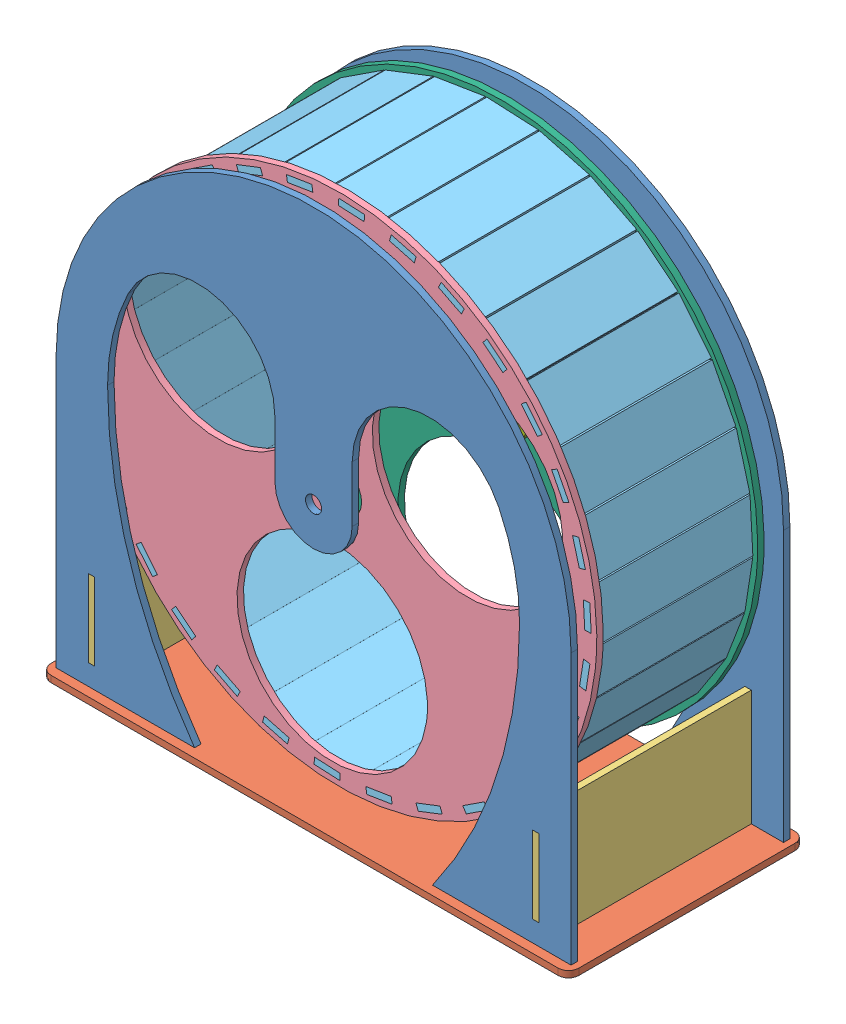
SolidWorks assembly Ultimate-Wheel-Asm-m2.SLDASM, configuration Default (file format 9000). Lengths in mm.
Overall size (266.14 269.59 116.84).
39 component instances, 7 part files, 25 mates.
Components (placement in the parent):
- base-side-m2-1: base-side-m2.SLDPRT [Default] at (11.9249 171.3012 224.943) size (254 263.53 3.17)
- base-bottom-m2-1: base-bottom-m2.SLDPRT [Default] at (11.9249 34.7762 174.143) x (1 0 0) z (0 1 0) size (260.35 116.84 3.17)
- base-side-m2-2: base-side-m2.SLDPRT [Default] at (11.9249 171.3012 120.168) size (254 263.53 3.17)
- base-support-m2-1: base-support-m2.SLDPRT [Default] at (123.0499 66.5262 174.143) x (0 0 -1) z (-1 0 0) size (107.95 60.33 3.17)
- base-support-m2-2: base-support-m2.SLDPRT [Default] at (-96.0251 66.5262 174.143) x (0 0 -1) z (-1 0 0) size (107.95 60.33 3.17)
- wheel-side-1: wheel-side.SLDPRT [Default] at (11.9249 171.3012 212.243) x (0.998799 -0.048992 0) z (0 0 1) size (254 254 3.17)
- footpath1-1: footpath1.SLDPRT [Default] at (135.8114 178.2098 174.143) x (0 0 1) z (-0.998449 -0.055679 0) size (82.55 25.4 3.17)
- wheel-side-screwhole-1: wheel-side-screwhole.SLDPRT [Default] at (11.9249 171.3012 132.868) x (0.998799 -0.048992 0) z (0 0 1) size (254 254 3.17)
- footpath1-2: footpath1.SLDPRT [Default] at (134.5406 152.3014 174.143) x (0 0 1) z (-0.988207 0.153127 0) size (82.55 25.4 3.17)
- footpath1-3: footpath1.SLDPRT [Default] at (127.9109 127.2233 174.143) x (0 0 1) z (-0.934775 0.35524 0) size (82.55 25.4 3.17)
- footpath1-4: footpath1.SLDPRT [Default] at (116.212 104.0717 174.143) x (0 0 1) z (-0.840489 0.541828 0) size (82.55 25.4 3.17)
- footpath1-5: footpath1.SLDPRT [Default] at (99.9553 83.8583 174.143) x (0 0 1) z (-0.70947 0.704735 0) size (82.55 25.4 3.17)
- footpath1-6: footpath1.SLDPRT [Default] at (79.8512 67.4666 174.143) x (0 0 1) z (-0.547444 0.836842 0) size (82.55 25.4 3.17)
- footpath1-7: footpath1.SLDPRT [Default] at (56.7785 55.613 174.143) x (0 0 1) z (-0.361492 0.932375 0) size (82.55 25.4 3.17)
- footpath1-8: footpath1.SLDPRT [Default] at (31.7454 48.8155 174.143) x (0 0 1) z (-0.159741 0.987159 0) size (82.55 25.4 3.17)
- footpath1-9: footpath1.SLDPRT [Default] at (5.846 47.3712 174.143) x (0 0 1) z (0.048992 0.998799 0) size (82.55 25.4 3.17)
- footpath1-10: footpath1.SLDPRT [Default] at (-19.7876 51.3432 174.143) x (0 0 1) z (0.255584 0.966787 0) size (82.55 25.4 3.17)
- footpath1-11: footpath1.SLDPRT [Default] at (-44.0353 60.558 174.143) x (0 0 1) z (0.451005 0.892522 0) size (82.55 25.4 3.17)
- footpath1-12: footpath1.SLDPRT [Default] at (-65.8372 74.6128 174.143) x (0 0 1) z (0.626715 0.779249 0) size (82.55 25.4 3.17)
- footpath1-13: footpath1.SLDPRT [Default] at (-84.2406 92.8933 174.143) x (0 0 1) z (0.775035 0.631919 0) size (82.55 25.4 3.17)
- footpath1-14: footpath1.SLDPRT [Default] at (-98.4411 114.6006 174.143) x (0 0 1) z (0.889481 0.456971 0) size (82.55 25.4 3.17)
- footpath1-15: footpath1.SLDPRT [Default] at (-107.818 138.7861 174.143) x (0 0 1) z (0.965054 0.262052 0) size (82.55 25.4 3.17)
- footpath1-16: footpath1.SLDPRT [Default] at (-111.9616 164.3925 174.143) x (0 0 1) z (0.998449 0.055679 0) size (82.55 25.4 3.17)
- footpath1-17: footpath1.SLDPRT [Default] at (-110.6908 190.301 174.143) x (0 0 1) z (0.988207 -0.153127 0) size (82.55 25.4 3.17)
- footpath1-18: footpath1.SLDPRT [Default] at (-104.061 215.379 174.143) x (0 0 1) z (0.934775 -0.35524 0) size (82.55 25.4 3.17)
- footpath1-19: footpath1.SLDPRT [Default] at (-92.3622 238.5306 174.143) x (0 0 1) z (0.840489 -0.541828 0) size (82.55 25.4 3.17)
- footpath1-20: footpath1.SLDPRT [Default] at (-76.1054 258.744 174.143) x (0 0 1) z (0.70947 -0.704735 0) size (82.55 25.4 3.17)
- footpath1-21: footpath1.SLDPRT [Default] at (-56.0014 275.1357 174.143) x (0 0 1) z (0.547444 -0.836842 0) size (82.55 25.4 3.17)
- footpath1-22: footpath1.SLDPRT [Default] at (-32.9286 286.9894 174.143) x (0 0 1) z (0.361492 -0.932375 0) size (82.55 25.4 3.17)
- footpath1-23: footpath1.SLDPRT [Default] at (-7.8955 293.7869 174.143) x (0 0 1) z (0.159741 -0.987159 0) size (82.55 25.4 3.17)
- footpath1-24: footpath1.SLDPRT [Default] at (18.0038 295.2312 174.143) x (0 0 1) z (-0.048992 -0.998799 0) size (82.55 25.4 3.17)
- footpath1-25: footpath1.SLDPRT [Default] at (43.6375 291.2591 174.143) x (0 0 1) z (-0.255584 -0.966787 0) size (82.55 25.4 3.17)
- footpath1-26: footpath1.SLDPRT [Default] at (67.8851 282.0444 174.143) x (0 0 1) z (-0.451005 -0.892522 0) size (82.55 25.4 3.17)
- footpath1-27: footpath1.SLDPRT [Default] at (89.6871 267.9896 174.143) x (0 0 1) z (-0.626715 -0.779249 0) size (82.55 25.4 3.17)
- footpath1-28: footpath1.SLDPRT [Default] at (108.0904 249.709 174.143) x (0 0 1) z (-0.775035 -0.631919 0) size (82.55 25.4 3.17)
- footpath1-29: footpath1.SLDPRT [Default] at (122.2909 228.0017 174.143) x (0 0 1) z (-0.889481 -0.456971 0) size (82.55 25.4 3.17)
- footpath1-30: footpath1.SLDPRT [Default] at (131.6678 203.8163 174.143) x (0 0 1) z (-0.965054 -0.262052 0) size (82.55 25.4 3.17)
- wheel-side-bearing-support-1: wheel-side-bearing-support.SLDPRT [Default] at (11.9249 171.3012 209.068) x (0.998008 -0.063093 0) z (0 0 1) size (34 34 3.17)
- wheel-side-bearing-support-2: wheel-side-bearing-support.SLDPRT [Default] at (11.9249 171.3012 136.043) x (0.986552 -0.163447 0) z (0 0 1) size (34 34 3.17)
Mates (geometry in assembly coordinates):
- Coincident1: coincident anti-aligned: plane of base-side-m2-1 through (11.9249 171.3012 228.118) normal (0 0 1); plane of base-bottom-m2-1 through (11.9249 37.9512 228.118) normal (0 0 -1)
- Coincident2: coincident anti-aligned: plane of base-side-m2-1 through (126.2249 34.7762 228.118) normal (1 0 0); plane of base-bottom-m2-1 through (126.2249 37.9512 174.143) normal (-1 0 0)
- Coincident3: coincident aligned: plane of base-side-m2-1 through (11.9249 34.7762 224.943) normal (0 -1 0); plane of base-bottom-m2-1 through (11.9249 34.7762 174.143) normal (0 -1 0)
- Coincident5: coincident anti-aligned: plane of base-bottom-m2-1 through (11.9249 37.9512 123.343) normal (0 0 -1); plane of base-side-m2-2 through (11.9249 171.3012 123.343) normal (0 0 1)
- Coincident6: coincident anti-aligned: plane of base-bottom-m2-1 through (126.2249 37.9512 174.143) normal (-1 0 0); plane of base-side-m2-2 through (126.2249 34.7762 123.343) normal (1 0 0)
- Coincident7: coincident aligned: plane of base-bottom-m2-1 through (11.9249 34.7762 174.143) normal (0 -1 0); plane of base-side-m2-2 through (11.9249 34.7762 120.168) normal (0 -1 0)
- Coincident8: coincident aligned: plane of base-bottom-m2-1 through (11.9249 34.7762 174.143) normal (0 -1 0); plane of base-support-m2-1 through (123.0499 34.7762 174.143) normal (0 -1 0)
- Coincident9: coincident anti-aligned: plane of base-bottom-m2-1 through (123.0499 37.9512 174.143) normal (-1 0 0); plane of base-support-m2-1 through (123.0499 66.5262 174.143) normal (1 0 0)
- Coincident10: coincident aligned: plane of base-side-m2-1 through (11.9249 171.3012 228.118) normal (0 0 1); plane of base-support-m2-1 through (123.0499 66.5262 228.118) normal (0 0 1)
- Coincident12: coincident aligned: plane of base-bottom-m2-1 through (11.9249 34.7762 174.143) normal (0 -1 0); plane of base-support-m2-2 through (-96.0251 34.7762 174.143) normal (0 -1 0)
- Coincident14: coincident anti-aligned: plane of base-bottom-m2-1 through (-99.2001 37.9512 174.143) normal (1 0 0); plane of base-support-m2-2 through (-99.2001 66.5262 174.143) normal (-1 0 0)
- Coincident15: coincident anti-aligned: plane of base-bottom-m2-1 through (11.9249 37.9512 161.443) normal (0 0 -1); plane of base-support-m2-2 through (-96.0251 34.7762 161.443) normal (0 0 1)
- Concentric1: concentric aligned: circle of base-side-m2-1; circle of wheel-side-1
- Distance1: distance = 9.525 mm anti-aligned: plane of base-side-m2-1 through (11.9249 171.3012 224.943) normal (0 0 -1); plane of wheel-side-1 through (11.9249 171.3012 215.418) normal (0 0 1)
- Coincident17: coincident aligned: plane of wheel-side-1 through (11.9249 171.3012 215.418) normal (0 0 1); plane of footpath1-1 through (132.6414 178.033 215.418) normal (0 0 1)
- Coincident18: coincident anti-aligned: plane of wheel-side-1 through (136.165 171.8696 215.418) normal (-0.998449 -0.055679 0); plane of footpath1-1 through (135.8114 178.2098 174.143) normal (0.998449 0.055679 0)
- Coincident19: coincident anti-aligned: plane of wheel-side-1 through (132.2878 184.3732 215.418) normal (0.055679 -0.998449 0); plane of footpath1-1 through (132.2878 184.3732 174.143) normal (-0.055679 0.998449 0)
- Concentric2: concentric aligned: circle of base-side-m2-1; circle of wheel-side-screwhole-1
- Coincident20: coincident anti-aligned: plane of footpath1-1 through (135.8114 178.2098 174.143) normal (0.998449 0.055679 0); plane of wheel-side-screwhole-1 through (136.165 171.8696 136.043) normal (-0.998449 -0.055679 0)
- Coincident21: coincident anti-aligned: plane of footpath1-1 through (132.2878 184.3732 174.143) normal (-0.055679 0.998449 0); plane of wheel-side-screwhole-1 through (132.2878 184.3732 136.043) normal (0.055679 -0.998449 0)
- Coincident22: coincident aligned: plane of footpath1-1 through (132.6414 178.033 132.868) normal (0 0 -1); plane of wheel-side-screwhole-1 through (11.9249 171.3012 132.868) normal (0 0 -1)
- Coincident23: coincident aligned: circle of wheel-side-1; circle of wheel-side-bearing-support-1
- Lock1: lock: unknown of wheel-side-1; unknown of wheel-side-bearing-support-1
- Coincident25: coincident aligned: circle of wheel-side-screwhole-1; circle of wheel-side-bearing-support-2
- Lock2: lock: unknown of wheel-side-screwhole-1; unknown of wheel-side-bearing-support-2
